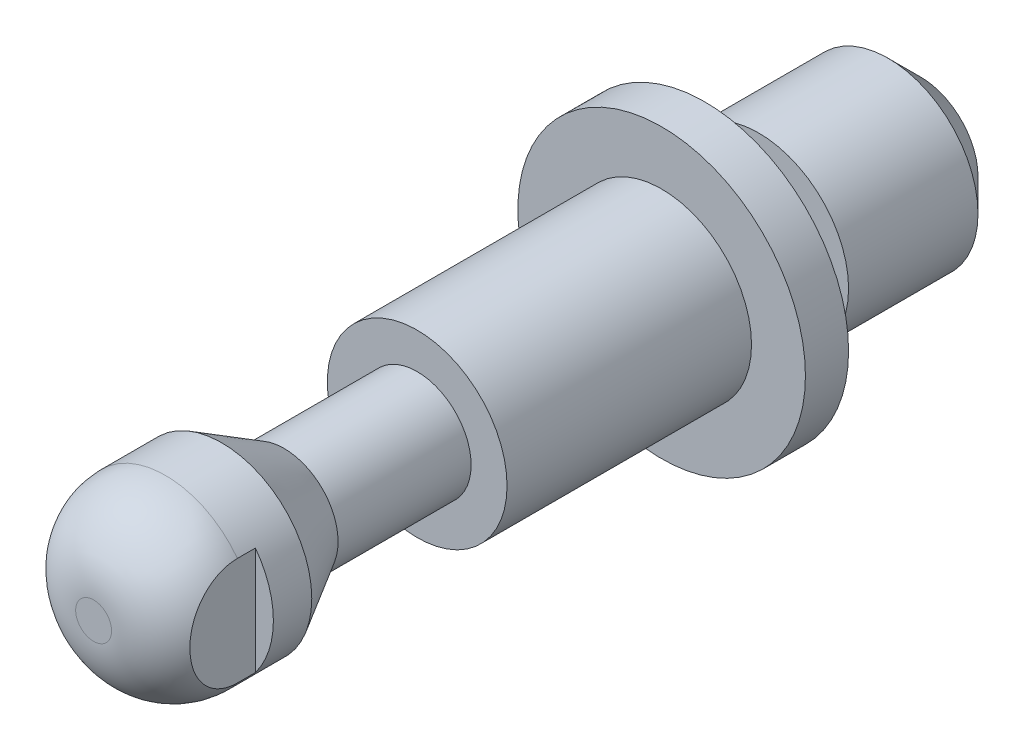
ISO-10303-21;
HEADER;
FILE_DESCRIPTION(('STEP AP214'),'2;1');
FILE_NAME('part.step','',(''),(''),'','','');
FILE_SCHEMA(('AUTOMOTIVE_DESIGN { 1 0 10303 214 1 1 1 1 }'));
ENDSEC;
DATA;
#1=APPLICATION_CONTEXT('core data for automotive mechanical design processes');
#2=APPLICATION_PROTOCOL_DEFINITION('international standard','automotive_design',2000,#1);
#3=PRODUCT_CONTEXT('',#1,'mechanical');
#4=PRODUCT('Part','Part','',(#3));
#5=PRODUCT_RELATED_PRODUCT_CATEGORY('part','',(#4));
#6=PRODUCT_DEFINITION_FORMATION('','',#4);
#7=PRODUCT_DEFINITION_CONTEXT('part definition',#1,'design');
#8=PRODUCT_DEFINITION('design','',#6,#7);
#9=PRODUCT_DEFINITION_SHAPE('','',#8);
#10=(LENGTH_UNIT() NAMED_UNIT(*) SI_UNIT(.MILLI.,.METRE.));
#11=(NAMED_UNIT(*) PLANE_ANGLE_UNIT() SI_UNIT($,.RADIAN.));
#12=(NAMED_UNIT(*) SI_UNIT($,.STERADIAN.) SOLID_ANGLE_UNIT());
#13=UNCERTAINTY_MEASURE_WITH_UNIT(LENGTH_MEASURE(1.E-05),#10,'distance_accuracy_value','');
#14=(GEOMETRIC_REPRESENTATION_CONTEXT(3) GLOBAL_UNCERTAINTY_ASSIGNED_CONTEXT((#13)) GLOBAL_UNIT_ASSIGNED_CONTEXT((#10,
#11,#12)) REPRESENTATION_CONTEXT('',''));
#15=CARTESIAN_POINT('',(0.,0.,0.));
#16=DIRECTION('',(0.,0.,1.));
#17=DIRECTION('',(1.,0.,0.));
#18=AXIS2_PLACEMENT_3D('',#15,#16,#17);
#19=CARTESIAN_POINT('',(0.,0.,0.));
#20=DIRECTION('',(0.,0.,-1.));
#21=DIRECTION('',(1.,0.,0.));
#22=AXIS2_PLACEMENT_3D('',#19,#20,#21);
#23=CYLINDRICAL_SURFACE('',#22,4.);
#24=CARTESIAN_POINT('',(0.,0.,0.));
#25=DIRECTION('',(0.,0.,-1.));
#26=DIRECTION('',(1.,0.,0.));
#27=AXIS2_PLACEMENT_3D('',#24,#25,#26);
#28=CIRCLE('',#27,4.);
#29=CARTESIAN_POINT('',(4.,0.,0.));
#30=VERTEX_POINT('',#29);
#31=EDGE_CURVE('E128',#30,#30,#28,.T.);
#32=ORIENTED_EDGE('',*,*,#31,.F.);
#33=EDGE_LOOP('',(#32));
#34=FACE_BOUND('',#33,.T.);
#35=CARTESIAN_POINT('',(0.,0.,1.2));
#36=DIRECTION('',(0.,0.,-1.));
#37=DIRECTION('',(1.,0.,0.));
#38=AXIS2_PLACEMENT_3D('',#35,#36,#37);
#39=CIRCLE('',#38,4.);
#40=CARTESIAN_POINT('',(4.,0.,1.2));
#41=VERTEX_POINT('',#40);
#42=EDGE_CURVE('E92',#41,#41,#39,.T.);
#43=ORIENTED_EDGE('',*,*,#42,.T.);
#44=EDGE_LOOP('',(#43));
#45=FACE_BOUND('',#44,.T.);
#46=ADVANCED_FACE('F15',(#34,#45),#23,.T.);
#47=CARTESIAN_POINT('',(0.,-1.85,0.));
#48=DIRECTION('',(0.,0.,1.));
#49=DIRECTION('',(-1.,0.,0.));
#50=AXIS2_PLACEMENT_3D('',#47,#48,#49);
#51=PLANE('',#50);
#52=CARTESIAN_POINT('',(0.,0.,0.));
#53=DIRECTION('',(0.,0.,-1.));
#54=DIRECTION('',(1.,0.,0.));
#55=AXIS2_PLACEMENT_3D('',#52,#53,#54);
#56=CIRCLE('',#55,1.85);
#57=CARTESIAN_POINT('',(1.85,0.,0.));
#58=VERTEX_POINT('',#57);
#59=EDGE_CURVE('E124',#58,#58,#56,.T.);
#60=ORIENTED_EDGE('',*,*,#59,.F.);
#61=EDGE_LOOP('',(#60));
#62=FACE_BOUND('',#61,.T.);
#63=ORIENTED_EDGE('',*,*,#31,.T.);
#64=EDGE_LOOP('',(#63));
#65=FACE_BOUND('',#64,.T.);
#66=ADVANCED_FACE('F181',(#62,#65),#51,.F.);
#67=CARTESIAN_POINT('',(0.,0.,0.));
#68=DIRECTION('',(0.,0.,-1.));
#69=DIRECTION('',(1.,0.,0.));
#70=AXIS2_PLACEMENT_3D('',#67,#68,#69);
#71=CYLINDRICAL_SURFACE('',#70,1.85);
#72=CARTESIAN_POINT('',(0.,0.,-1.5));
#73=DIRECTION('',(0.,0.,-1.));
#74=DIRECTION('',(1.,0.,0.));
#75=AXIS2_PLACEMENT_3D('',#72,#73,#74);
#76=CIRCLE('',#75,1.85);
#77=CARTESIAN_POINT('',(1.85,0.,-1.5));
#78=VERTEX_POINT('',#77);
#79=EDGE_CURVE('E120',#78,#78,#76,.T.);
#80=ORIENTED_EDGE('',*,*,#79,.F.);
#81=EDGE_LOOP('',(#80));
#82=FACE_BOUND('',#81,.T.);
#83=ORIENTED_EDGE('',*,*,#59,.T.);
#84=EDGE_LOOP('',(#83));
#85=FACE_BOUND('',#84,.T.);
#86=ADVANCED_FACE('F187',(#82,#85),#71,.T.);
#87=CARTESIAN_POINT('',(0.,-1.85,-1.5));
#88=DIRECTION('',(0.,0.,-1.));
#89=DIRECTION('',(1.,0.,0.));
#90=AXIS2_PLACEMENT_3D('',#87,#88,#89);
#91=PLANE('',#90);
#92=CARTESIAN_POINT('',(0.,0.,-1.5));
#93=DIRECTION('',(0.,0.,-1.));
#94=DIRECTION('',(1.,0.,0.));
#95=AXIS2_PLACEMENT_3D('',#92,#93,#94);
#96=CIRCLE('',#95,2.5);
#97=CARTESIAN_POINT('',(2.5,0.,-1.5));
#98=VERTEX_POINT('',#97);
#99=EDGE_CURVE('E116',#98,#98,#96,.T.);
#100=ORIENTED_EDGE('',*,*,#99,.F.);
#101=EDGE_LOOP('',(#100));
#102=FACE_BOUND('',#101,.T.);
#103=ORIENTED_EDGE('',*,*,#79,.T.);
#104=EDGE_LOOP('',(#103));
#105=FACE_BOUND('',#104,.T.);
#106=ADVANCED_FACE('F195',(#102,#105),#91,.F.);
#107=CARTESIAN_POINT('',(0.,0.,0.));
#108=DIRECTION('',(0.,0.,-1.));
#109=DIRECTION('',(1.,0.,0.));
#110=AXIS2_PLACEMENT_3D('',#107,#108,#109);
#111=CYLINDRICAL_SURFACE('',#110,2.5);
#112=CARTESIAN_POINT('',(0.,0.,-5.1));
#113=DIRECTION('',(0.,0.,1.));
#114=DIRECTION('',(1.,0.,0.));
#115=AXIS2_PLACEMENT_3D('',#112,#113,#114);
#116=CIRCLE('',#115,2.5);
#117=CARTESIAN_POINT('',(2.5,0.,-5.1));
#118=VERTEX_POINT('',#117);
#119=EDGE_CURVE('E9',#118,#118,#116,.T.);
#120=ORIENTED_EDGE('',*,*,#119,.T.);
#121=EDGE_LOOP('',(#120));
#122=FACE_BOUND('',#121,.T.);
#123=ORIENTED_EDGE('',*,*,#99,.T.);
#124=EDGE_LOOP('',(#123));
#125=FACE_BOUND('',#124,.T.);
#126=ADVANCED_FACE('F199',(#122,#125),#111,.T.);
#127=CARTESIAN_POINT('',(0.,-2.5,-6.));
#128=DIRECTION('',(0.,0.,1.));
#129=DIRECTION('',(-1.,0.,0.));
#130=AXIS2_PLACEMENT_3D('',#127,#128,#129);
#131=PLANE('',#130);
#132=CARTESIAN_POINT('',(0.,0.,-6.));
#133=DIRECTION('',(0.,0.,1.));
#134=DIRECTION('',(1.,0.,0.));
#135=AXIS2_PLACEMENT_3D('',#132,#133,#134);
#136=CIRCLE('',#135,1.6);
#137=CARTESIAN_POINT('',(1.6,0.,-6.));
#138=VERTEX_POINT('',#137);
#139=EDGE_CURVE('E24',#138,#138,#136,.F.);
#140=ORIENTED_EDGE('',*,*,#139,.T.);
#141=EDGE_LOOP('',(#140));
#142=FACE_BOUND('',#141,.T.);
#143=ADVANCED_FACE('F171',(#142),#131,.F.);
#144=CARTESIAN_POINT('',(0.,0.,17.));
#145=DIRECTION('',(0.,0.,-1.));
#146=DIRECTION('',(1.,0.,0.));
#147=AXIS2_PLACEMENT_3D('',#144,#145,#146);
#148=PLANE('',#147);
#149=CARTESIAN_POINT('',(0.,0.,17.));
#150=DIRECTION('',(0.,0.,-1.));
#151=DIRECTION('',(1.,0.,0.));
#152=AXIS2_PLACEMENT_3D('',#149,#150,#151);
#153=CIRCLE('',#152,0.5);
#154=CARTESIAN_POINT('',(0.500000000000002,0.,17.));
#155=VERTEX_POINT('',#154);
#156=EDGE_CURVE('E134',#155,#155,#153,.F.);
#157=ORIENTED_EDGE('',*,*,#156,.T.);
#158=EDGE_LOOP('',(#157));
#159=FACE_BOUND('',#158,.T.);
#160=ADVANCED_FACE('F206',(#159),#148,.F.);
#161=CARTESIAN_POINT('',(0.,0.,0.));
#162=DIRECTION('',(0.,0.,-1.));
#163=DIRECTION('',(1.,0.,0.));
#164=AXIS2_PLACEMENT_3D('',#161,#162,#163);
#165=CYLINDRICAL_SURFACE('',#164,2.5);
#166=CARTESIAN_POINT('',(0.,0.,15.));
#167=DIRECTION('',(0.,0.,-1.));
#168=DIRECTION('',(1.,0.,0.));
#169=AXIS2_PLACEMENT_3D('',#166,#167,#168);
#170=CIRCLE('',#169,2.5);
#171=CARTESIAN_POINT('',(-2.,1.50000000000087,15.));
#172=VERTEX_POINT('',#171);
#173=CARTESIAN_POINT('',(2.,1.5,15.));
#174=VERTEX_POINT('',#173);
#175=EDGE_CURVE('E75',#172,#174,#170,.T.);
#176=ORIENTED_EDGE('',*,*,#175,.T.);
#177=DIRECTION('',(0.,0.,-1.));
#178=VECTOR('',#177,1.);
#179=CARTESIAN_POINT('',(2.,1.5,0.));
#180=LINE('',#179,#178);
#181=CARTESIAN_POINT('',(2.,1.5,14.5));
#182=VERTEX_POINT('',#181);
#183=EDGE_CURVE('E31',#174,#182,#180,.T.);
#184=ORIENTED_EDGE('',*,*,#183,.T.);
#185=CARTESIAN_POINT('',(0.,0.,14.5));
#186=DIRECTION('',(0.,0.,-1.));
#187=DIRECTION('',(1.,0.,0.));
#188=AXIS2_PLACEMENT_3D('',#185,#186,#187);
#189=CIRCLE('',#188,2.5);
#190=CARTESIAN_POINT('',(2.,-1.5,14.5));
#191=VERTEX_POINT('',#190);
#192=EDGE_CURVE('E60',#182,#191,#189,.T.);
#193=ORIENTED_EDGE('',*,*,#192,.T.);
#194=DIRECTION('',(0.,0.,-1.));
#195=VECTOR('',#194,1.);
#196=CARTESIAN_POINT('',(2.,-1.5,0.));
#197=LINE('',#196,#195);
#198=CARTESIAN_POINT('',(2.,-1.50000000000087,15.));
#199=VERTEX_POINT('',#198);
#200=EDGE_CURVE('E67',#191,#199,#197,.F.);
#201=ORIENTED_EDGE('',*,*,#200,.T.);
#202=CARTESIAN_POINT('',(-2.,-1.5,15.));
#203=VERTEX_POINT('',#202);
#204=EDGE_CURVE('E39',#199,#203,#170,.T.);
#205=ORIENTED_EDGE('',*,*,#204,.T.);
#206=DIRECTION('',(0.,0.,-1.));
#207=VECTOR('',#206,1.);
#208=CARTESIAN_POINT('',(-2.,-1.5,0.));
#209=LINE('',#208,#207);
#210=CARTESIAN_POINT('',(-2.,-1.5,14.5));
#211=VERTEX_POINT('',#210);
#212=EDGE_CURVE('E89',#203,#211,#209,.T.);
#213=ORIENTED_EDGE('',*,*,#212,.T.);
#214=CARTESIAN_POINT('',(0.,0.,14.5));
#215=DIRECTION('',(0.,0.,-1.));
#216=DIRECTION('',(1.,0.,0.));
#217=AXIS2_PLACEMENT_3D('',#214,#215,#216);
#218=CIRCLE('',#217,2.5);
#219=CARTESIAN_POINT('',(-2.,1.5,14.5));
#220=VERTEX_POINT('',#219);
#221=EDGE_CURVE('E146',#211,#220,#218,.T.);
#222=ORIENTED_EDGE('',*,*,#221,.T.);
#223=DIRECTION('',(0.,0.,-1.));
#224=VECTOR('',#223,1.);
#225=CARTESIAN_POINT('',(-2.,1.5,0.));
#226=LINE('',#225,#224);
#227=EDGE_CURVE('E83',#220,#172,#226,.F.);
#228=ORIENTED_EDGE('',*,*,#227,.T.);
#229=EDGE_LOOP('',(#176,#184,#193,#201,#205,#213,#222,#228));
#230=FACE_BOUND('',#229,.T.);
#231=CARTESIAN_POINT('',(0.,0.,13.4320508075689));
#232=DIRECTION('',(0.,0.,-1.));
#233=DIRECTION('',(1.,0.,0.));
#234=AXIS2_PLACEMENT_3D('',#231,#232,#233);
#235=CIRCLE('',#234,2.5);
#236=CARTESIAN_POINT('',(2.5,0.,13.4320508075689));
#237=VERTEX_POINT('',#236);
#238=EDGE_CURVE('E112',#237,#237,#235,.T.);
#239=ORIENTED_EDGE('',*,*,#238,.F.);
#240=EDGE_LOOP('',(#239));
#241=FACE_BOUND('',#240,.T.);
#242=ADVANCED_FACE('F71',(#230,#241),#165,.T.);
#243=CARTESIAN_POINT('',(0.,0.,13.4320508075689));
#244=DIRECTION('',(0.,0.,1.));
#245=DIRECTION('',(-1.,0.,0.));
#246=AXIS2_PLACEMENT_3D('',#243,#244,#245);
#247=CONICAL_SURFACE('',#246,2.5,0.523598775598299);
#248=CARTESIAN_POINT('',(0.,0.,11.7));
#249=DIRECTION('',(0.,0.,-1.));
#250=DIRECTION('',(1.,0.,0.));
#251=AXIS2_PLACEMENT_3D('',#248,#249,#250);
#252=CIRCLE('',#251,1.5);
#253=CARTESIAN_POINT('',(1.5,0.,11.7));
#254=VERTEX_POINT('',#253);
#255=EDGE_CURVE('E108',#254,#254,#252,.T.);
#256=ORIENTED_EDGE('',*,*,#255,.F.);
#257=EDGE_LOOP('',(#256));
#258=FACE_BOUND('',#257,.T.);
#259=ORIENTED_EDGE('',*,*,#238,.T.);
#260=EDGE_LOOP('',(#259));
#261=FACE_BOUND('',#260,.T.);
#262=ADVANCED_FACE('F212',(#258,#261),#247,.T.);
#263=CARTESIAN_POINT('',(0.,0.,0.));
#264=DIRECTION('',(0.,0.,-1.));
#265=DIRECTION('',(1.,0.,0.));
#266=AXIS2_PLACEMENT_3D('',#263,#264,#265);
#267=CYLINDRICAL_SURFACE('',#266,1.5);
#268=CARTESIAN_POINT('',(0.,0.,8.));
#269=DIRECTION('',(0.,0.,-1.));
#270=DIRECTION('',(1.,0.,0.));
#271=AXIS2_PLACEMENT_3D('',#268,#269,#270);
#272=CIRCLE('',#271,1.5);
#273=CARTESIAN_POINT('',(1.5,0.,8.));
#274=VERTEX_POINT('',#273);
#275=EDGE_CURVE('E104',#274,#274,#272,.T.);
#276=ORIENTED_EDGE('',*,*,#275,.F.);
#277=EDGE_LOOP('',(#276));
#278=FACE_BOUND('',#277,.T.);
#279=ORIENTED_EDGE('',*,*,#255,.T.);
#280=EDGE_LOOP('',(#279));
#281=FACE_BOUND('',#280,.T.);
#282=ADVANCED_FACE('F215',(#278,#281),#267,.T.);
#283=CARTESIAN_POINT('',(0.,-1.5,8.));
#284=DIRECTION('',(0.,0.,-1.));
#285=DIRECTION('',(1.,0.,0.));
#286=AXIS2_PLACEMENT_3D('',#283,#284,#285);
#287=PLANE('',#286);
#288=CARTESIAN_POINT('',(0.,0.,8.));
#289=DIRECTION('',(0.,0.,-1.));
#290=DIRECTION('',(1.,0.,0.));
#291=AXIS2_PLACEMENT_3D('',#288,#289,#290);
#292=CIRCLE('',#291,2.5);
#293=CARTESIAN_POINT('',(2.5,0.,8.));
#294=VERTEX_POINT('',#293);
#295=EDGE_CURVE('E100',#294,#294,#292,.T.);
#296=ORIENTED_EDGE('',*,*,#295,.F.);
#297=EDGE_LOOP('',(#296));
#298=FACE_BOUND('',#297,.T.);
#299=ORIENTED_EDGE('',*,*,#275,.T.);
#300=EDGE_LOOP('',(#299));
#301=FACE_BOUND('',#300,.T.);
#302=ADVANCED_FACE('F219',(#298,#301),#287,.F.);
#303=CARTESIAN_POINT('',(0.,0.,0.));
#304=DIRECTION('',(0.,0.,-1.));
#305=DIRECTION('',(1.,0.,0.));
#306=AXIS2_PLACEMENT_3D('',#303,#304,#305);
#307=CYLINDRICAL_SURFACE('',#306,2.5);
#308=CARTESIAN_POINT('',(0.,0.,1.2));
#309=DIRECTION('',(0.,0.,-1.));
#310=DIRECTION('',(1.,0.,0.));
#311=AXIS2_PLACEMENT_3D('',#308,#309,#310);
#312=CIRCLE('',#311,2.5);
#313=CARTESIAN_POINT('',(2.5,0.,1.2));
#314=VERTEX_POINT('',#313);
#315=EDGE_CURVE('E96',#314,#314,#312,.T.);
#316=ORIENTED_EDGE('',*,*,#315,.F.);
#317=EDGE_LOOP('',(#316));
#318=FACE_BOUND('',#317,.T.);
#319=ORIENTED_EDGE('',*,*,#295,.T.);
#320=EDGE_LOOP('',(#319));
#321=FACE_BOUND('',#320,.T.);
#322=ADVANCED_FACE('F223',(#318,#321),#307,.T.);
#323=CARTESIAN_POINT('',(0.,-4.,1.2));
#324=DIRECTION('',(0.,0.,-1.));
#325=DIRECTION('',(1.,0.,0.));
#326=AXIS2_PLACEMENT_3D('',#323,#324,#325);
#327=PLANE('',#326);
#328=ORIENTED_EDGE('',*,*,#42,.F.);
#329=EDGE_LOOP('',(#328));
#330=FACE_BOUND('',#329,.T.);
#331=ORIENTED_EDGE('',*,*,#315,.T.);
#332=EDGE_LOOP('',(#331));
#333=FACE_BOUND('',#332,.T.);
#334=ADVANCED_FACE('F226',(#330,#333),#327,.F.);
#335=CARTESIAN_POINT('',(0.,0.,15.));
#336=DIRECTION('',(0.,0.,-1.));
#337=DIRECTION('',(1.,0.,0.));
#338=AXIS2_PLACEMENT_3D('',#335,#336,#337);
#339=DEGENERATE_TOROIDAL_SURFACE('',#338,0.5,2.,.T.);
#340=CARTESIAN_POINT('',(2.,0.,16.3228756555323));
#341=CARTESIAN_POINT('',(2.,-0.10228286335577,16.3228758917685));
#342=CARTESIAN_POINT('',(2.,-0.204694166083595,16.3139867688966));
#343=CARTESIAN_POINT('',(2.,-0.406512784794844,16.2781707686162));
#344=CARTESIAN_POINT('',(2.,-0.505914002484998,16.2512095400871));
#345=CARTESIAN_POINT('',(2.,-0.692258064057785,16.1809929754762));
#346=CARTESIAN_POINT('',(2.,-0.779589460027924,16.1387810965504));
#347=CARTESIAN_POINT('',(2.,-0.944367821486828,16.0382236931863));
#348=CARTESIAN_POINT('',(2.,-1.02183096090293,15.9799050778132));
#349=CARTESIAN_POINT('',(2.,-1.15377375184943,15.8568418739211));
#350=CARTESIAN_POINT('',(2.,-1.20992899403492,15.7938951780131));
#351=CARTESIAN_POINT('',(2.,-1.30903611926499,15.6583285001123));
#352=CARTESIAN_POINT('',(2.,-1.35199840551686,15.5857162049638));
#353=CARTESIAN_POINT('',(2.,-1.41803440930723,15.4428853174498));
#354=CARTESIAN_POINT('',(2.,-1.44292272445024,15.3735017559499));
#355=CARTESIAN_POINT('',(2.,-1.47976583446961,15.2313867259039));
#356=CARTESIAN_POINT('',(2.,-1.49172712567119,15.1586569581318));
#357=CARTESIAN_POINT('',(2.,-1.50183363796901,15.0171132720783));
#358=CARTESIAN_POINT('',(2.,-1.50084260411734,14.9483595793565));
#359=CARTESIAN_POINT('',(2.,-1.48717054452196,14.8120331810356));
#360=CARTESIAN_POINT('',(2.,-1.47449130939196,14.7444602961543));
#361=CARTESIAN_POINT('',(2.,-1.43817755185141,14.6132392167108));
#362=CARTESIAN_POINT('',(2.,-1.41468005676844,14.5495528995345));
#363=CARTESIAN_POINT('',(2.,-1.35766202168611,14.4268515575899));
#364=CARTESIAN_POINT('',(2.,-1.32414065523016,14.3678369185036));
#365=CARTESIAN_POINT('',(2.,-1.2469695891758,14.2539324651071));
#366=CARTESIAN_POINT('',(2.,-1.20301666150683,14.1992486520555));
#367=CARTESIAN_POINT('',(2.,-1.10716106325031,14.0973841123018));
#368=CARTESIAN_POINT('',(2.,-1.05525631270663,14.0502053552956));
#369=CARTESIAN_POINT('',(2.,-0.940758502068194,13.960658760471));
#370=CARTESIAN_POINT('',(2.,-0.877647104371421,13.9189552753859));
#371=CARTESIAN_POINT('',(2.,-0.745920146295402,13.8454442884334));
#372=CARTESIAN_POINT('',(2.,-0.677302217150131,13.8136410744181));
#373=CARTESIAN_POINT('',(2.,-0.527914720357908,13.7567980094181));
#374=CARTESIAN_POINT('',(2.,-0.446669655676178,13.7330094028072));
#375=CARTESIAN_POINT('',(2.,-0.281546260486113,13.6977114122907));
#376=CARTESIAN_POINT('',(2.,-0.197666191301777,13.6862103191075));
#377=CARTESIAN_POINT('',(2.,-0.0185671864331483,13.674659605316));
#378=CARTESIAN_POINT('',(2.,0.0767589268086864,13.6762204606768));
#379=CARTESIAN_POINT('',(2.,0.265956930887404,13.6947387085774));
#380=CARTESIAN_POINT('',(2.,0.359828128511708,13.7117032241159));
#381=CARTESIAN_POINT('',(2.,0.54632967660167,13.762114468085));
#382=CARTESIAN_POINT('',(2.,0.638825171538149,13.7960691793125));
#383=CARTESIAN_POINT('',(2.,0.815765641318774,13.8808497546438));
#384=CARTESIAN_POINT('',(2.,0.900217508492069,13.9316610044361));
#385=CARTESIAN_POINT('',(2.,1.0486011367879,14.0432052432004));
#386=CARTESIAN_POINT('',(2.,1.11376119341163,14.1022988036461));
#387=CARTESIAN_POINT('',(2.,1.2312760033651,14.2320942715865));
#388=CARTESIAN_POINT('',(2.,1.28364363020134,14.3027843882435));
#389=CARTESIAN_POINT('',(2.,1.3667065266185,14.4432157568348));
#390=CARTESIAN_POINT('',(2.,1.39937412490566,14.511794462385));
#391=CARTESIAN_POINT('',(2.,1.45154611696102,14.6537870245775));
#392=CARTESIAN_POINT('',(2.,1.47105823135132,14.7271980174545));
#393=CARTESIAN_POINT('',(2.,1.49497029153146,14.8701916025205));
#394=CARTESIAN_POINT('',(2.,1.50048503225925,14.9395897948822));
#395=CARTESIAN_POINT('',(2.,1.49944838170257,15.0782881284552));
#396=CARTESIAN_POINT('',(2.,1.49289984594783,15.1475882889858));
#397=CARTESIAN_POINT('',(2.,1.46833269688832,15.2822688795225));
#398=CARTESIAN_POINT('',(2.,1.4506129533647,15.3477042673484));
#399=CARTESIAN_POINT('',(2.,1.40466413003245,15.4747634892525));
#400=CARTESIAN_POINT('',(2.,1.37643461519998,15.536387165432));
#401=CARTESIAN_POINT('',(2.,1.30977280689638,15.6555979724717));
#402=CARTESIAN_POINT('',(2.,1.27113180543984,15.7130680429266));
#403=CARTESIAN_POINT('',(2.,1.18531026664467,15.8212046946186));
#404=CARTESIAN_POINT('',(2.,1.13812853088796,15.8718703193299));
#405=CARTESIAN_POINT('',(2.,1.03335725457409,15.9686437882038));
#406=CARTESIAN_POINT('',(2.,0.975285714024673,16.0142284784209));
#407=CARTESIAN_POINT('',(2.,0.852927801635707,16.0961331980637));
#408=CARTESIAN_POINT('',(2.,0.788636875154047,16.1324463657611));
#409=CARTESIAN_POINT('',(2.,0.648264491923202,16.199051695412));
#410=CARTESIAN_POINT('',(2.,0.571663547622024,16.228244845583));
#411=CARTESIAN_POINT('',(2.,0.415079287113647,16.2749849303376));
#412=CARTESIAN_POINT('',(2.,0.335099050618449,16.2925422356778));
#413=CARTESIAN_POINT('',(2.,0.212244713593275,16.3105569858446));
#414=CARTESIAN_POINT('',(2.,0.169937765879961,16.3151768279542));
#415=CARTESIAN_POINT('',(2.,0.0850946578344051,16.32133646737));
#416=CARTESIAN_POINT('',(2.,0.0425584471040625,16.3228755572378));
#417=CARTESIAN_POINT('',(2.,0.,16.3228756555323));
#418=B_SPLINE_CURVE_WITH_KNOTS('',3,(#340,#341,#342,#343,#344,#345,#346,#347,#348,#349,#350,
#351,#352,#353,#354,#355,#356,#357,#358,#359,#360,#361,#362,#363,#364,#365,#366,#367,#368,#369,
#370,#371,#372,#373,#374,#375,#376,#377,#378,#379,#380,#381,#382,#383,#384,#385,#386,#387,#388,
#389,#390,#391,#392,#393,#394,#395,#396,#397,#398,#399,#400,#401,#402,#403,#404,#405,#406,#407,
#408,#409,#410,#411,#412,#413,#414,#415,#416,#417),.UNSPECIFIED.,.T.,.F.,(4,2,2,2,2,2,2,2,2,2,2,
2,2,2,2,2,2,2,2,2,2,2,2,2,2,2,2,2,2,2,2,2,2,2,2,2,2,2,4),(0.,0.306678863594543,
0.613942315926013,0.903262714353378,1.19210264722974,1.44370292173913,1.69510428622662,
1.91508563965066,2.13495639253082,2.34024400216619,2.54550016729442,2.74822514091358,
2.95096683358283,3.16054022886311,3.37016853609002,3.59618340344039,3.82229602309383,
4.07525351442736,4.32838157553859,4.61313893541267,4.89802804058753,5.19199518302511,
5.4857081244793,5.74804939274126,6.01012555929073,6.23678799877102,6.46331729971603,
6.67114182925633,6.87891717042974,7.08135684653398,7.28380490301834,7.49065963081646,
7.6975434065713,7.91811168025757,8.13884272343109,8.38381180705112,8.62856226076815,
8.75613768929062,8.88374240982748),.UNSPECIFIED.);
#419=EDGE_CURVE('E64',#174,#199,#418,.T.);
#420=ORIENTED_EDGE('',*,*,#419,.F.);
#421=ORIENTED_EDGE('',*,*,#175,.F.);
#422=CARTESIAN_POINT('',(-2.,0.,16.3228756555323));
#423=CARTESIAN_POINT('',(-2.,0.102282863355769,16.3228758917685));
#424=CARTESIAN_POINT('',(-2.,0.204694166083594,16.3139867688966));
#425=CARTESIAN_POINT('',(-2.,0.406512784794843,16.2781707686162));
#426=CARTESIAN_POINT('',(-2.,0.505914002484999,16.2512095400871));
#427=CARTESIAN_POINT('',(-2.,0.692258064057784,16.1809929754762));
#428=CARTESIAN_POINT('',(-2.,0.779589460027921,16.1387810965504));
#429=CARTESIAN_POINT('',(-2.,0.944367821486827,16.0382236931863));
#430=CARTESIAN_POINT('',(-2.,1.02183096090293,15.9799050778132));
#431=CARTESIAN_POINT('',(-2.,1.15377375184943,15.8568418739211));
#432=CARTESIAN_POINT('',(-2.,1.20992899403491,15.7938951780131));
#433=CARTESIAN_POINT('',(-2.,1.30903611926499,15.6583285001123));
#434=CARTESIAN_POINT('',(-2.,1.35199840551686,15.5857162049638));
#435=CARTESIAN_POINT('',(-2.,1.41803440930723,15.4428853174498));
#436=CARTESIAN_POINT('',(-2.,1.44292272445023,15.3735017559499));
#437=CARTESIAN_POINT('',(-2.,1.47976583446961,15.2313867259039));
#438=CARTESIAN_POINT('',(-2.,1.49172712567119,15.1586569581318));
#439=CARTESIAN_POINT('',(-2.,1.50183363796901,15.0171132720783));
#440=CARTESIAN_POINT('',(-2.,1.50084260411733,14.9483595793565));
#441=CARTESIAN_POINT('',(-2.,1.48717054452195,14.8120331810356));
#442=CARTESIAN_POINT('',(-2.,1.47449130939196,14.7444602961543));
#443=CARTESIAN_POINT('',(-2.,1.43817755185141,14.6132392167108));
#444=CARTESIAN_POINT('',(-2.,1.41468005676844,14.5495528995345));
#445=CARTESIAN_POINT('',(-2.,1.35766202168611,14.4268515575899));
#446=CARTESIAN_POINT('',(-2.,1.32414065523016,14.3678369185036));
#447=CARTESIAN_POINT('',(-2.,1.2469695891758,14.2539324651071));
#448=CARTESIAN_POINT('',(-2.,1.20301666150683,14.1992486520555));
#449=CARTESIAN_POINT('',(-2.,1.10716106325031,14.0973841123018));
#450=CARTESIAN_POINT('',(-2.,1.05525631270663,14.0502053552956));
#451=CARTESIAN_POINT('',(-2.,0.940758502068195,13.960658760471));
#452=CARTESIAN_POINT('',(-2.,0.877647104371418,13.9189552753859));
#453=CARTESIAN_POINT('',(-2.,0.745920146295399,13.8454442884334));
#454=CARTESIAN_POINT('',(-2.,0.67730221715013,13.8136410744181));
#455=CARTESIAN_POINT('',(-2.,0.527914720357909,13.7567980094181));
#456=CARTESIAN_POINT('',(-2.,0.446669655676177,13.7330094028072));
#457=CARTESIAN_POINT('',(-2.,0.281546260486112,13.6977114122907));
#458=CARTESIAN_POINT('',(-2.,0.197666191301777,13.6862103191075));
#459=CARTESIAN_POINT('',(-2.,0.0185671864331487,13.674659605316));
#460=CARTESIAN_POINT('',(-2.,-0.0767589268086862,13.6762204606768));
#461=CARTESIAN_POINT('',(-2.,-0.265956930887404,13.6947387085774));
#462=CARTESIAN_POINT('',(-2.,-0.359828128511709,13.7117032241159));
#463=CARTESIAN_POINT('',(-2.,-0.546329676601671,13.762114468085));
#464=CARTESIAN_POINT('',(-2.,-0.638825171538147,13.7960691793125));
#465=CARTESIAN_POINT('',(-2.,-0.815765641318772,13.8808497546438));
#466=CARTESIAN_POINT('',(-2.,-0.900217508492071,13.9316610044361));
#467=CARTESIAN_POINT('',(-2.,-1.0486011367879,14.0432052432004));
#468=CARTESIAN_POINT('',(-2.,-1.11376119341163,14.1022988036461));
#469=CARTESIAN_POINT('',(-2.,-1.23127600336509,14.2320942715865));
#470=CARTESIAN_POINT('',(-2.,-1.28364363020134,14.3027843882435));
#471=CARTESIAN_POINT('',(-2.,-1.3667065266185,14.4432157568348));
#472=CARTESIAN_POINT('',(-2.,-1.39937412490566,14.511794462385));
#473=CARTESIAN_POINT('',(-2.,-1.45154611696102,14.6537870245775));
#474=CARTESIAN_POINT('',(-2.,-1.47105823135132,14.7271980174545));
#475=CARTESIAN_POINT('',(-2.,-1.49497029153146,14.8701916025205));
#476=CARTESIAN_POINT('',(-2.,-1.50048503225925,14.9395897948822));
#477=CARTESIAN_POINT('',(-2.,-1.49944838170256,15.0782881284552));
#478=CARTESIAN_POINT('',(-2.,-1.49289984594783,15.1475882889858));
#479=CARTESIAN_POINT('',(-2.,-1.46833269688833,15.2822688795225));
#480=CARTESIAN_POINT('',(-2.,-1.4506129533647,15.3477042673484));
#481=CARTESIAN_POINT('',(-2.,-1.40466413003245,15.4747634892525));
#482=CARTESIAN_POINT('',(-2.,-1.37643461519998,15.536387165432));
#483=CARTESIAN_POINT('',(-2.,-1.30977280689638,15.6555979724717));
#484=CARTESIAN_POINT('',(-2.,-1.27113180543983,15.7130680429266));
#485=CARTESIAN_POINT('',(-2.,-1.18531026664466,15.8212046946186));
#486=CARTESIAN_POINT('',(-2.,-1.13812853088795,15.8718703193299));
#487=CARTESIAN_POINT('',(-2.,-1.03335725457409,15.9686437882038));
#488=CARTESIAN_POINT('',(-2.,-0.975285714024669,16.0142284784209));
#489=CARTESIAN_POINT('',(-2.,-0.852927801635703,16.0961331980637));
#490=CARTESIAN_POINT('',(-2.,-0.788636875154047,16.1324463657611));
#491=CARTESIAN_POINT('',(-2.,-0.648264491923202,16.199051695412));
#492=CARTESIAN_POINT('',(-2.,-0.571663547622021,16.228244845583));
#493=CARTESIAN_POINT('',(-2.,-0.415079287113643,16.2749849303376));
#494=CARTESIAN_POINT('',(-2.,-0.335099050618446,16.2925422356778));
#495=CARTESIAN_POINT('',(-2.,-0.212244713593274,16.3105569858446));
#496=CARTESIAN_POINT('',(-2.,-0.16993776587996,16.3151768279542));
#497=CARTESIAN_POINT('',(-2.,-0.0850946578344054,16.32133646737));
#498=CARTESIAN_POINT('',(-2.,-0.0425584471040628,16.3228755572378));
#499=CARTESIAN_POINT('',(-2.,0.,16.3228756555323));
#500=B_SPLINE_CURVE_WITH_KNOTS('',3,(#422,#423,#424,#425,#426,#427,#428,#429,#430,#431,#432,
#433,#434,#435,#436,#437,#438,#439,#440,#441,#442,#443,#444,#445,#446,#447,#448,#449,#450,#451,
#452,#453,#454,#455,#456,#457,#458,#459,#460,#461,#462,#463,#464,#465,#466,#467,#468,#469,#470,
#471,#472,#473,#474,#475,#476,#477,#478,#479,#480,#481,#482,#483,#484,#485,#486,#487,#488,#489,
#490,#491,#492,#493,#494,#495,#496,#497,#498,#499),.UNSPECIFIED.,.T.,.F.,(4,2,2,2,2,2,2,2,2,2,2,
2,2,2,2,2,2,2,2,2,2,2,2,2,2,2,2,2,2,2,2,2,2,2,2,2,2,2,4),(0.,0.306678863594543,
0.613942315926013,0.903262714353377,1.19210264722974,1.44370292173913,1.69510428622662,
1.91508563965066,2.13495639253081,2.34024400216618,2.54550016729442,2.74822514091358,
2.95096683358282,3.1605402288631,3.37016853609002,3.59618340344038,3.82229602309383,
4.07525351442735,4.32838157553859,4.61313893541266,4.89802804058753,5.1919951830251,
5.48570812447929,5.74804939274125,6.01012555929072,6.23678799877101,6.46331729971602,
6.67114182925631,6.87891717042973,7.08135684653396,7.28380490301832,7.49065963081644,
7.69754340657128,7.91811168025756,8.13884272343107,8.3838118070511,8.62856226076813,
8.7561376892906,8.88374240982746),.UNSPECIFIED.);
#501=EDGE_CURVE('E138',#203,#172,#500,.T.);
#502=ORIENTED_EDGE('',*,*,#501,.F.);
#503=ORIENTED_EDGE('',*,*,#204,.F.);
#504=EDGE_LOOP('',(#420,#421,#502,#503));
#505=FACE_BOUND('',#504,.T.);
#506=ORIENTED_EDGE('',*,*,#156,.F.);
#507=EDGE_LOOP('',(#506));
#508=FACE_BOUND('',#507,.T.);
#509=ADVANCED_FACE('F148',(#505,#508),#339,.T.);
#510=CARTESIAN_POINT('',(-3.25,-2.5,14.5));
#511=DIRECTION('',(0.,0.,-1.));
#512=DIRECTION('',(1.,0.,0.));
#513=AXIS2_PLACEMENT_3D('',#510,#511,#512);
#514=PLANE('',#513);
#515=DIRECTION('',(0.,1.,0.));
#516=VECTOR('',#515,1.);
#517=CARTESIAN_POINT('',(-2.,-2.5,14.5));
#518=LINE('',#517,#516);
#519=EDGE_CURVE('E77',#211,#220,#518,.T.);
#520=ORIENTED_EDGE('',*,*,#519,.T.);
#521=ORIENTED_EDGE('',*,*,#221,.F.);
#522=EDGE_LOOP('',(#520,#521));
#523=FACE_BOUND('',#522,.T.);
#524=ADVANCED_FACE('F155',(#523),#514,.F.);
#525=CARTESIAN_POINT('',(-2.,-2.5,14.5));
#526=DIRECTION('',(1.,0.,0.));
#527=DIRECTION('',(0.,-1.,0.));
#528=AXIS2_PLACEMENT_3D('',#525,#526,#527);
#529=PLANE('',#528);
#530=ORIENTED_EDGE('',*,*,#501,.T.);
#531=ORIENTED_EDGE('',*,*,#227,.F.);
#532=ORIENTED_EDGE('',*,*,#519,.F.);
#533=ORIENTED_EDGE('',*,*,#212,.F.);
#534=EDGE_LOOP('',(#530,#531,#532,#533));
#535=FACE_BOUND('',#534,.T.);
#536=ADVANCED_FACE('F151',(#535),#529,.F.);
#537=CARTESIAN_POINT('',(2.,2.5,14.5));
#538=DIRECTION('',(0.,0.,-1.));
#539=DIRECTION('',(1.,0.,0.));
#540=AXIS2_PLACEMENT_3D('',#537,#538,#539);
#541=PLANE('',#540);
#542=DIRECTION('',(0.,-1.,0.));
#543=VECTOR('',#542,1.);
#544=CARTESIAN_POINT('',(2.,-2.5,14.5));
#545=LINE('',#544,#543);
#546=EDGE_CURVE('E62',#182,#191,#545,.T.);
#547=ORIENTED_EDGE('',*,*,#546,.T.);
#548=ORIENTED_EDGE('',*,*,#192,.F.);
#549=EDGE_LOOP('',(#547,#548));
#550=FACE_BOUND('',#549,.T.);
#551=ADVANCED_FACE('F61',(#550),#541,.F.);
#552=CARTESIAN_POINT('',(2.,-2.5,14.5));
#553=DIRECTION('',(-1.,0.,0.));
#554=DIRECTION('',(0.,1.,0.));
#555=AXIS2_PLACEMENT_3D('',#552,#553,#554);
#556=PLANE('',#555);
#557=ORIENTED_EDGE('',*,*,#419,.T.);
#558=ORIENTED_EDGE('',*,*,#200,.F.);
#559=ORIENTED_EDGE('',*,*,#546,.F.);
#560=ORIENTED_EDGE('',*,*,#183,.F.);
#561=EDGE_LOOP('',(#557,#558,#559,#560));
#562=FACE_BOUND('',#561,.T.);
#563=ADVANCED_FACE('F66',(#562),#556,.F.);
#564=CARTESIAN_POINT('',(0.,0.,-6.));
#565=DIRECTION('',(0.,0.,1.));
#566=DIRECTION('',(1.,0.,0.));
#567=AXIS2_PLACEMENT_3D('',#564,#565,#566);
#568=CONICAL_SURFACE('',#567,1.6,0.785398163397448);
#569=ORIENTED_EDGE('',*,*,#119,.F.);
#570=EDGE_LOOP('',(#569));
#571=FACE_BOUND('',#570,.T.);
#572=ORIENTED_EDGE('',*,*,#139,.F.);
#573=EDGE_LOOP('',(#572));
#574=FACE_BOUND('',#573,.T.);
#575=ADVANCED_FACE('F17',(#571,#574),#568,.T.);
#576=CLOSED_SHELL('',(#46,#66,#86,#106,#126,#143,#160,#242,#262,#282,#302,#322,#334,#509,#524,
#536,#551,#563,#575));
#577=MANIFOLD_SOLID_BREP('B1',#576);
#578=ADVANCED_BREP_SHAPE_REPRESENTATION('',(#18,#577),#14);
#579=SHAPE_DEFINITION_REPRESENTATION(#9,#578);
ENDSEC;
END-ISO-10303-21;
